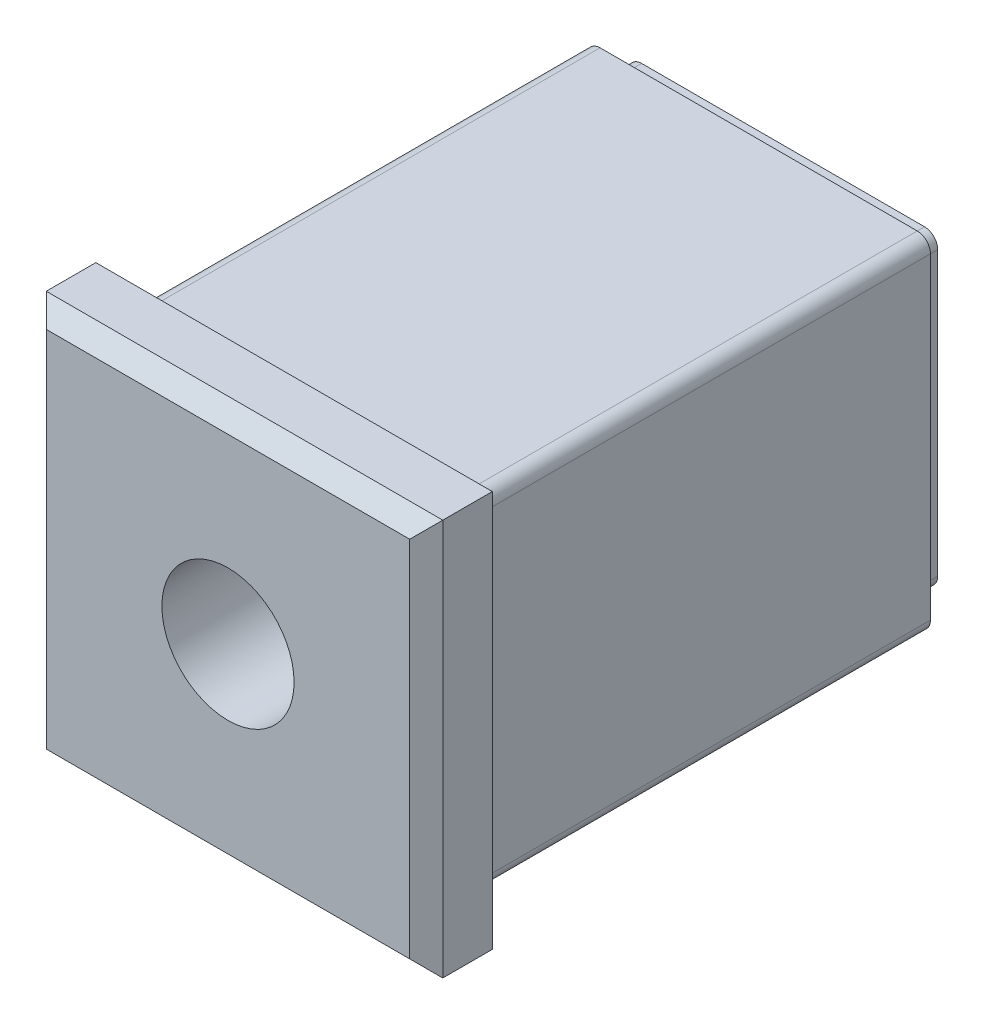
ISO-10303-21;
HEADER;
FILE_DESCRIPTION(('STEP AP214'),'2;1');
FILE_NAME('part.step','',(''),(''),'','','');
FILE_SCHEMA(('AUTOMOTIVE_DESIGN { 1 0 10303 214 1 1 1 1 }'));
ENDSEC;
DATA;
#1=APPLICATION_CONTEXT('core data for automotive mechanical design processes');
#2=APPLICATION_PROTOCOL_DEFINITION('international standard','automotive_design',2000,#1);
#3=PRODUCT_CONTEXT('',#1,'mechanical');
#4=PRODUCT('Part','Part','',(#3));
#5=PRODUCT_RELATED_PRODUCT_CATEGORY('part','',(#4));
#6=PRODUCT_DEFINITION_FORMATION('','',#4);
#7=PRODUCT_DEFINITION_CONTEXT('part definition',#1,'design');
#8=PRODUCT_DEFINITION('design','',#6,#7);
#9=PRODUCT_DEFINITION_SHAPE('','',#8);
#10=(LENGTH_UNIT() NAMED_UNIT(*) SI_UNIT(.MILLI.,.METRE.));
#11=(NAMED_UNIT(*) PLANE_ANGLE_UNIT() SI_UNIT($,.RADIAN.));
#12=(NAMED_UNIT(*) SI_UNIT($,.STERADIAN.) SOLID_ANGLE_UNIT());
#13=UNCERTAINTY_MEASURE_WITH_UNIT(LENGTH_MEASURE(1.E-05),#10,'distance_accuracy_value','');
#14=(GEOMETRIC_REPRESENTATION_CONTEXT(3) GLOBAL_UNCERTAINTY_ASSIGNED_CONTEXT((#13)) GLOBAL_UNIT_ASSIGNED_CONTEXT((#10,
#11,#12)) REPRESENTATION_CONTEXT('',''));
#15=CARTESIAN_POINT('',(0.,0.,0.));
#16=DIRECTION('',(0.,0.,1.));
#17=DIRECTION('',(1.,0.,0.));
#18=AXIS2_PLACEMENT_3D('',#15,#16,#17);
#19=CARTESIAN_POINT('',(37.,-15.,3.75));
#20=DIRECTION('',(0.,0.707106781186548,-0.707106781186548));
#21=DIRECTION('',(0.,-0.707106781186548,-0.707106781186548));
#22=AXIS2_PLACEMENT_3D('',#19,#20,#21);
#23=PLANE('',#22);
#24=DIRECTION('',(1.,0.,0.));
#25=VECTOR('',#24,1.);
#26=CARTESIAN_POINT('',(0.,-15.,3.75));
#27=LINE('',#26,#25);
#28=CARTESIAN_POINT('',(-15.,-15.,3.75));
#29=VERTEX_POINT('',#28);
#30=CARTESIAN_POINT('',(15.,-15.,3.75));
#31=VERTEX_POINT('',#30);
#32=EDGE_CURVE('E339',#29,#31,#27,.T.);
#33=ORIENTED_EDGE('',*,*,#32,.T.);
#34=DIRECTION('',(0.577350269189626,-0.577350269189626,-0.577350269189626));
#35=VECTOR('',#34,1.);
#36=CARTESIAN_POINT('',(13.75,-13.75,5.));
#37=LINE('',#36,#35);
#38=CARTESIAN_POINT('',(13.75,-13.75,5.));
#39=VERTEX_POINT('',#38);
#40=EDGE_CURVE('E238',#39,#31,#37,.T.);
#41=ORIENTED_EDGE('',*,*,#40,.F.);
#42=DIRECTION('',(-1.,0.,0.));
#43=VECTOR('',#42,1.);
#44=CARTESIAN_POINT('',(-13.75,-13.75,5.));
#45=LINE('',#44,#43);
#46=CARTESIAN_POINT('',(-13.75,-13.75,5.));
#47=VERTEX_POINT('',#46);
#48=EDGE_CURVE('E353',#47,#39,#45,.F.);
#49=ORIENTED_EDGE('',*,*,#48,.F.);
#50=DIRECTION('',(0.577350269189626,0.577350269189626,0.577350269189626));
#51=VECTOR('',#50,1.);
#52=CARTESIAN_POINT('',(-15.,-15.,3.75));
#53=LINE('',#52,#51);
#54=EDGE_CURVE('E354',#29,#47,#53,.T.);
#55=ORIENTED_EDGE('',*,*,#54,.F.);
#56=EDGE_LOOP('',(#33,#41,#49,#55));
#57=FACE_BOUND('',#56,.T.);
#58=ADVANCED_FACE('F14',(#57),#23,.F.);
#59=CARTESIAN_POINT('',(13.75,0.,5.));
#60=DIRECTION('',(0.707106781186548,0.,0.707106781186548));
#61=DIRECTION('',(-0.707106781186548,0.,0.707106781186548));
#62=AXIS2_PLACEMENT_3D('',#59,#60,#61);
#63=PLANE('',#62);
#64=DIRECTION('',(0.,-1.,0.));
#65=VECTOR('',#64,1.);
#66=CARTESIAN_POINT('',(15.,0.,3.75));
#67=LINE('',#66,#65);
#68=CARTESIAN_POINT('',(15.,15.,3.75));
#69=VERTEX_POINT('',#68);
#70=EDGE_CURVE('E360',#69,#31,#67,.T.);
#71=ORIENTED_EDGE('',*,*,#70,.F.);
#72=DIRECTION('',(-0.577350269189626,-0.577350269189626,0.577350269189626));
#73=VECTOR('',#72,1.);
#74=CARTESIAN_POINT('',(15.,15.,3.75));
#75=LINE('',#74,#73);
#76=CARTESIAN_POINT('',(13.75,13.75,5.));
#77=VERTEX_POINT('',#76);
#78=EDGE_CURVE('E189',#69,#77,#75,.T.);
#79=ORIENTED_EDGE('',*,*,#78,.T.);
#80=DIRECTION('',(0.,1.,0.));
#81=VECTOR('',#80,1.);
#82=CARTESIAN_POINT('',(13.75,0.,5.));
#83=LINE('',#82,#81);
#84=EDGE_CURVE('E366',#39,#77,#83,.T.);
#85=ORIENTED_EDGE('',*,*,#84,.F.);
#86=ORIENTED_EDGE('',*,*,#40,.T.);
#87=EDGE_LOOP('',(#71,#79,#85,#86));
#88=FACE_BOUND('',#87,.T.);
#89=ADVANCED_FACE('F437',(#88),#63,.T.);
#90=CARTESIAN_POINT('',(-13.75,0.,5.));
#91=DIRECTION('',(0.,0.,1.));
#92=DIRECTION('',(0.,1.,0.));
#93=AXIS2_PLACEMENT_3D('',#90,#91,#92);
#94=PLANE('',#93);
#95=ORIENTED_EDGE('',*,*,#84,.T.);
#96=DIRECTION('',(-1.,0.,0.));
#97=VECTOR('',#96,1.);
#98=CARTESIAN_POINT('',(13.75,13.75,5.));
#99=LINE('',#98,#97);
#100=CARTESIAN_POINT('',(-13.75,13.75,5.));
#101=VERTEX_POINT('',#100);
#102=EDGE_CURVE('E163',#77,#101,#99,.T.);
#103=ORIENTED_EDGE('',*,*,#102,.T.);
#104=DIRECTION('',(0.,1.,0.));
#105=VECTOR('',#104,1.);
#106=CARTESIAN_POINT('',(-13.75,0.,5.));
#107=LINE('',#106,#105);
#108=EDGE_CURVE('E350',#101,#47,#107,.F.);
#109=ORIENTED_EDGE('',*,*,#108,.T.);
#110=ORIENTED_EDGE('',*,*,#48,.T.);
#111=EDGE_LOOP('',(#95,#103,#109,#110));
#112=FACE_BOUND('',#111,.T.);
#113=CARTESIAN_POINT('',(0.,0.,5.));
#114=DIRECTION('',(0.,0.,1.));
#115=DIRECTION('',(0.,1.,0.));
#116=AXIS2_PLACEMENT_3D('',#113,#114,#115);
#117=CIRCLE('',#116,5.);
#118=CARTESIAN_POINT('',(0.,5.,5.));
#119=VERTEX_POINT('',#118);
#120=EDGE_CURVE('E198',#119,#119,#117,.F.);
#121=ORIENTED_EDGE('',*,*,#120,.T.);
#122=EDGE_LOOP('',(#121));
#123=FACE_BOUND('',#122,.T.);
#124=ADVANCED_FACE('F440',(#112,#123),#94,.T.);
#125=CARTESIAN_POINT('',(-15.,0.,3.75));
#126=DIRECTION('',(-0.707106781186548,0.,0.707106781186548));
#127=DIRECTION('',(-0.707106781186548,0.,-0.707106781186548));
#128=AXIS2_PLACEMENT_3D('',#125,#126,#127);
#129=PLANE('',#128);
#130=ORIENTED_EDGE('',*,*,#108,.F.);
#131=DIRECTION('',(-0.577350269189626,0.577350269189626,-0.577350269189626));
#132=VECTOR('',#131,1.);
#133=CARTESIAN_POINT('',(-13.75,13.75,5.));
#134=LINE('',#133,#132);
#135=CARTESIAN_POINT('',(-15.,15.,3.75));
#136=VERTEX_POINT('',#135);
#137=EDGE_CURVE('E192',#101,#136,#134,.T.);
#138=ORIENTED_EDGE('',*,*,#137,.T.);
#139=DIRECTION('',(0.,1.,0.));
#140=VECTOR('',#139,1.);
#141=CARTESIAN_POINT('',(-15.,0.,3.75));
#142=LINE('',#141,#140);
#143=EDGE_CURVE('E328',#29,#136,#142,.T.);
#144=ORIENTED_EDGE('',*,*,#143,.F.);
#145=ORIENTED_EDGE('',*,*,#54,.T.);
#146=EDGE_LOOP('',(#130,#138,#144,#145));
#147=FACE_BOUND('',#146,.T.);
#148=ADVANCED_FACE('F445',(#147),#129,.T.);
#149=CARTESIAN_POINT('',(15.,0.,-37.));
#150=DIRECTION('',(0.,0.,-1.));
#151=DIRECTION('',(0.,-1.,0.));
#152=AXIS2_PLACEMENT_3D('',#149,#150,#151);
#153=PLANE('',#152);
#154=DIRECTION('',(1.,0.,0.));
#155=VECTOR('',#154,1.);
#156=CARTESIAN_POINT('',(10.7,-11.7,-37.));
#157=LINE('',#156,#155);
#158=CARTESIAN_POINT('',(10.7,-11.7,-37.));
#159=VERTEX_POINT('',#158);
#160=CARTESIAN_POINT('',(-10.7,-11.7,-37.));
#161=VERTEX_POINT('',#160);
#162=EDGE_CURVE('E317',#159,#161,#157,.F.);
#163=ORIENTED_EDGE('',*,*,#162,.T.);
#164=CARTESIAN_POINT('',(-10.7,-10.7,-37.));
#165=DIRECTION('',(0.,0.,1.));
#166=DIRECTION('',(0.,1.,0.));
#167=AXIS2_PLACEMENT_3D('',#164,#165,#166);
#168=CIRCLE('',#167,1.);
#169=CARTESIAN_POINT('',(-11.7,-10.7,-37.));
#170=VERTEX_POINT('',#169);
#171=EDGE_CURVE('E363',#161,#170,#168,.F.);
#172=ORIENTED_EDGE('',*,*,#171,.T.);
#173=DIRECTION('',(0.,-1.,0.));
#174=VECTOR('',#173,1.);
#175=CARTESIAN_POINT('',(-11.7,-10.7,-37.));
#176=LINE('',#175,#174);
#177=CARTESIAN_POINT('',(-11.7,10.7,-37.));
#178=VERTEX_POINT('',#177);
#179=EDGE_CURVE('E322',#170,#178,#176,.F.);
#180=ORIENTED_EDGE('',*,*,#179,.T.);
#181=CARTESIAN_POINT('',(-10.7,10.7,-37.));
#182=DIRECTION('',(0.,0.,1.));
#183=DIRECTION('',(0.,1.,0.));
#184=AXIS2_PLACEMENT_3D('',#181,#182,#183);
#185=CIRCLE('',#184,1.);
#186=CARTESIAN_POINT('',(-10.7,11.7,-37.));
#187=VERTEX_POINT('',#186);
#188=EDGE_CURVE('E213',#178,#187,#185,.F.);
#189=ORIENTED_EDGE('',*,*,#188,.T.);
#190=DIRECTION('',(-1.,0.,0.));
#191=VECTOR('',#190,1.);
#192=CARTESIAN_POINT('',(-10.7,11.7,-37.));
#193=LINE('',#192,#191);
#194=CARTESIAN_POINT('',(10.7,11.7,-37.));
#195=VERTEX_POINT('',#194);
#196=EDGE_CURVE('E185',#187,#195,#193,.F.);
#197=ORIENTED_EDGE('',*,*,#196,.T.);
#198=CARTESIAN_POINT('',(10.7,10.7,-37.));
#199=DIRECTION('',(0.,0.,1.));
#200=DIRECTION('',(0.,1.,0.));
#201=AXIS2_PLACEMENT_3D('',#198,#199,#200);
#202=CIRCLE('',#201,1.);
#203=CARTESIAN_POINT('',(11.7,10.7,-37.));
#204=VERTEX_POINT('',#203);
#205=EDGE_CURVE('E195',#195,#204,#202,.F.);
#206=ORIENTED_EDGE('',*,*,#205,.T.);
#207=DIRECTION('',(0.,1.,0.));
#208=VECTOR('',#207,1.);
#209=CARTESIAN_POINT('',(11.7,10.7,-37.));
#210=LINE('',#209,#208);
#211=CARTESIAN_POINT('',(11.7,-10.7,-37.));
#212=VERTEX_POINT('',#211);
#213=EDGE_CURVE('E166',#204,#212,#210,.F.);
#214=ORIENTED_EDGE('',*,*,#213,.T.);
#215=CARTESIAN_POINT('',(10.7,-10.7,-37.));
#216=DIRECTION('',(0.,0.,1.));
#217=DIRECTION('',(0.,1.,0.));
#218=AXIS2_PLACEMENT_3D('',#215,#216,#217);
#219=CIRCLE('',#218,1.);
#220=EDGE_CURVE('E374',#212,#159,#219,.F.);
#221=ORIENTED_EDGE('',*,*,#220,.T.);
#222=EDGE_LOOP('',(#163,#172,#180,#189,#197,#206,#214,#221));
#223=FACE_BOUND('',#222,.T.);
#224=CARTESIAN_POINT('',(0.,0.,-37.));
#225=DIRECTION('',(0.,0.,-1.));
#226=DIRECTION('',(0.,-1.,0.));
#227=AXIS2_PLACEMENT_3D('',#224,#225,#226);
#228=CIRCLE('',#227,5.);
#229=CARTESIAN_POINT('',(0.,-5.,-37.));
#230=VERTEX_POINT('',#229);
#231=EDGE_CURVE('E649',#230,#230,#228,.T.);
#232=ORIENTED_EDGE('',*,*,#231,.F.);
#233=EDGE_LOOP('',(#232));
#234=FACE_BOUND('',#233,.T.);
#235=ADVANCED_FACE('F386',(#223,#234),#153,.T.);
#236=CARTESIAN_POINT('',(-15.,0.,-37.));
#237=DIRECTION('',(-1.,0.,0.));
#238=DIRECTION('',(0.,1.,0.));
#239=AXIS2_PLACEMENT_3D('',#236,#237,#238);
#240=PLANE('',#239);
#241=ORIENTED_EDGE('',*,*,#143,.T.);
#242=DIRECTION('',(0.,0.,-1.));
#243=VECTOR('',#242,1.);
#244=CARTESIAN_POINT('',(-15.,15.,5.));
#245=LINE('',#244,#243);
#246=CARTESIAN_POINT('',(-15.,15.,0.));
#247=VERTEX_POINT('',#246);
#248=EDGE_CURVE('E173',#136,#247,#245,.T.);
#249=ORIENTED_EDGE('',*,*,#248,.T.);
#250=DIRECTION('',(0.,-1.,0.));
#251=VECTOR('',#250,1.);
#252=CARTESIAN_POINT('',(-15.,0.,0.));
#253=LINE('',#252,#251);
#254=CARTESIAN_POINT('',(-15.,-15.,0.));
#255=VERTEX_POINT('',#254);
#256=EDGE_CURVE('E307',#255,#247,#253,.F.);
#257=ORIENTED_EDGE('',*,*,#256,.F.);
#258=DIRECTION('',(0.,0.,-1.));
#259=VECTOR('',#258,1.);
#260=CARTESIAN_POINT('',(-15.,-15.,-37.));
#261=LINE('',#260,#259);
#262=EDGE_CURVE('E331',#255,#29,#261,.F.);
#263=ORIENTED_EDGE('',*,*,#262,.T.);
#264=EDGE_LOOP('',(#241,#249,#257,#263));
#265=FACE_BOUND('',#264,.T.);
#266=ADVANCED_FACE('F465',(#265),#240,.T.);
#267=CARTESIAN_POINT('',(0.,-15.,5.));
#268=DIRECTION('',(0.,1.,0.));
#269=DIRECTION('',(1.,0.,0.));
#270=AXIS2_PLACEMENT_3D('',#267,#268,#269);
#271=PLANE('',#270);
#272=DIRECTION('',(0.,0.,-1.));
#273=VECTOR('',#272,1.);
#274=CARTESIAN_POINT('',(15.,-15.,5.));
#275=LINE('',#274,#273);
#276=CARTESIAN_POINT('',(15.,-15.,0.));
#277=VERTEX_POINT('',#276);
#278=EDGE_CURVE('E334',#31,#277,#275,.T.);
#279=ORIENTED_EDGE('',*,*,#278,.F.);
#280=ORIENTED_EDGE('',*,*,#32,.F.);
#281=ORIENTED_EDGE('',*,*,#262,.F.);
#282=DIRECTION('',(-1.,0.,0.));
#283=VECTOR('',#282,1.);
#284=CARTESIAN_POINT('',(0.,-15.,0.));
#285=LINE('',#284,#283);
#286=EDGE_CURVE('E330',#277,#255,#285,.T.);
#287=ORIENTED_EDGE('',*,*,#286,.F.);
#288=EDGE_LOOP('',(#279,#280,#281,#287));
#289=FACE_BOUND('',#288,.T.);
#290=ADVANCED_FACE('F468',(#289),#271,.F.);
#291=CARTESIAN_POINT('',(15.,0.,3.75));
#292=DIRECTION('',(1.,0.,0.));
#293=DIRECTION('',(0.,-1.,0.));
#294=AXIS2_PLACEMENT_3D('',#291,#292,#293);
#295=PLANE('',#294);
#296=ORIENTED_EDGE('',*,*,#70,.T.);
#297=ORIENTED_EDGE('',*,*,#278,.T.);
#298=DIRECTION('',(0.,-1.,0.));
#299=VECTOR('',#298,1.);
#300=CARTESIAN_POINT('',(15.,0.,0.));
#301=LINE('',#300,#299);
#302=CARTESIAN_POINT('',(15.,15.,0.));
#303=VERTEX_POINT('',#302);
#304=EDGE_CURVE('E313',#303,#277,#301,.T.);
#305=ORIENTED_EDGE('',*,*,#304,.F.);
#306=DIRECTION('',(0.,0.,-1.));
#307=VECTOR('',#306,1.);
#308=CARTESIAN_POINT('',(15.,15.,-37.));
#309=LINE('',#308,#307);
#310=EDGE_CURVE('E168',#303,#69,#309,.F.);
#311=ORIENTED_EDGE('',*,*,#310,.T.);
#312=EDGE_LOOP('',(#296,#297,#305,#311));
#313=FACE_BOUND('',#312,.T.);
#314=ADVANCED_FACE('F472',(#313),#295,.T.);
#315=CARTESIAN_POINT('',(12.,-13.,0.));
#316=DIRECTION('',(0.,1.,0.));
#317=DIRECTION('',(1.,0.,0.));
#318=AXIS2_PLACEMENT_3D('',#315,#316,#317);
#319=PLANE('',#318);
#320=DIRECTION('',(0.,0.,-1.));
#321=VECTOR('',#320,1.);
#322=CARTESIAN_POINT('',(12.,-13.,0.));
#323=LINE('',#322,#321);
#324=CARTESIAN_POINT('',(12.,-13.,0.));
#325=VERTEX_POINT('',#324);
#326=CARTESIAN_POINT('',(12.,-13.,-35.15));
#327=VERTEX_POINT('',#326);
#328=EDGE_CURVE('E24',#325,#327,#323,.T.);
#329=ORIENTED_EDGE('',*,*,#328,.F.);
#330=DIRECTION('',(1.,0.,0.));
#331=VECTOR('',#330,1.);
#332=CARTESIAN_POINT('',(12.,-13.,0.));
#333=LINE('',#332,#331);
#334=CARTESIAN_POINT('',(-12.,-13.,0.));
#335=VERTEX_POINT('',#334);
#336=EDGE_CURVE('E277',#335,#325,#333,.T.);
#337=ORIENTED_EDGE('',*,*,#336,.F.);
#338=DIRECTION('',(0.,0.,-1.));
#339=VECTOR('',#338,1.);
#340=CARTESIAN_POINT('',(-12.,-13.,0.));
#341=LINE('',#340,#339);
#342=CARTESIAN_POINT('',(-12.,-13.,-35.15));
#343=VERTEX_POINT('',#342);
#344=EDGE_CURVE('E274',#343,#335,#341,.F.);
#345=ORIENTED_EDGE('',*,*,#344,.F.);
#346=DIRECTION('',(1.,0.,0.));
#347=VECTOR('',#346,1.);
#348=CARTESIAN_POINT('',(12.,-13.,-35.15));
#349=LINE('',#348,#347);
#350=EDGE_CURVE('E9',#327,#343,#349,.F.);
#351=ORIENTED_EDGE('',*,*,#350,.F.);
#352=EDGE_LOOP('',(#329,#337,#345,#351));
#353=FACE_BOUND('',#352,.T.);
#354=ADVANCED_FACE('F475',(#353),#319,.F.);
#355=CARTESIAN_POINT('',(12.,-12.,0.));
#356=DIRECTION('',(0.,0.,1.));
#357=DIRECTION('',(0.,1.,0.));
#358=AXIS2_PLACEMENT_3D('',#355,#356,#357);
#359=CYLINDRICAL_SURFACE('',#358,1.);
#360=CARTESIAN_POINT('',(12.,-12.,0.));
#361=DIRECTION('',(0.,0.,1.));
#362=DIRECTION('',(0.,1.,0.));
#363=AXIS2_PLACEMENT_3D('',#360,#361,#362);
#364=CIRCLE('',#363,1.);
#365=CARTESIAN_POINT('',(13.,-12.,0.));
#366=VERTEX_POINT('',#365);
#367=EDGE_CURVE('E293',#366,#325,#364,.F.);
#368=ORIENTED_EDGE('',*,*,#367,.T.);
#369=ORIENTED_EDGE('',*,*,#328,.T.);
#370=CARTESIAN_POINT('',(12.,-12.,-35.15));
#371=DIRECTION('',(0.,0.,1.));
#372=DIRECTION('',(0.,1.,0.));
#373=AXIS2_PLACEMENT_3D('',#370,#371,#372);
#374=CIRCLE('',#373,1.);
#375=CARTESIAN_POINT('',(13.,-12.,-35.15));
#376=VERTEX_POINT('',#375);
#377=EDGE_CURVE('E32',#376,#327,#374,.F.);
#378=ORIENTED_EDGE('',*,*,#377,.F.);
#379=DIRECTION('',(0.,0.,1.));
#380=VECTOR('',#379,1.);
#381=CARTESIAN_POINT('',(13.,-12.,0.));
#382=LINE('',#381,#380);
#383=EDGE_CURVE('E302',#376,#366,#382,.T.);
#384=ORIENTED_EDGE('',*,*,#383,.T.);
#385=EDGE_LOOP('',(#368,#369,#378,#384));
#386=FACE_BOUND('',#385,.T.);
#387=ADVANCED_FACE('F510',(#386),#359,.T.);
#388=CARTESIAN_POINT('',(13.,12.,0.));
#389=DIRECTION('',(-1.,0.,0.));
#390=DIRECTION('',(0.,1.,0.));
#391=AXIS2_PLACEMENT_3D('',#388,#389,#390);
#392=PLANE('',#391);
#393=DIRECTION('',(0.,-1.,0.));
#394=VECTOR('',#393,1.);
#395=CARTESIAN_POINT('',(13.,0.,-35.15));
#396=LINE('',#395,#394);
#397=CARTESIAN_POINT('',(13.,12.,-35.15));
#398=VERTEX_POINT('',#397);
#399=EDGE_CURVE('E152',#398,#376,#396,.T.);
#400=ORIENTED_EDGE('',*,*,#399,.F.);
#401=DIRECTION('',(0.,0.,1.));
#402=VECTOR('',#401,1.);
#403=CARTESIAN_POINT('',(13.,12.,0.));
#404=LINE('',#403,#402);
#405=CARTESIAN_POINT('',(13.,12.,0.));
#406=VERTEX_POINT('',#405);
#407=EDGE_CURVE('E181',#406,#398,#404,.F.);
#408=ORIENTED_EDGE('',*,*,#407,.F.);
#409=DIRECTION('',(0.,-1.,0.));
#410=VECTOR('',#409,1.);
#411=CARTESIAN_POINT('',(13.,0.,0.));
#412=LINE('',#411,#410);
#413=EDGE_CURVE('E300',#366,#406,#412,.F.);
#414=ORIENTED_EDGE('',*,*,#413,.F.);
#415=ORIENTED_EDGE('',*,*,#383,.F.);
#416=EDGE_LOOP('',(#400,#408,#414,#415));
#417=FACE_BOUND('',#416,.T.);
#418=ADVANCED_FACE('F402',(#417),#392,.F.);
#419=CARTESIAN_POINT('',(11.7,10.7,-35.15));
#420=DIRECTION('',(-1.,0.,0.));
#421=DIRECTION('',(0.,1.,0.));
#422=AXIS2_PLACEMENT_3D('',#419,#420,#421);
#423=PLANE('',#422);
#424=ORIENTED_EDGE('',*,*,#213,.F.);
#425=DIRECTION('',(0.,0.,-1.));
#426=VECTOR('',#425,1.);
#427=CARTESIAN_POINT('',(11.7,10.7,-35.15));
#428=LINE('',#427,#426);
#429=CARTESIAN_POINT('',(11.7,10.7,-35.15));
#430=VERTEX_POINT('',#429);
#431=EDGE_CURVE('E159',#430,#204,#428,.T.);
#432=ORIENTED_EDGE('',*,*,#431,.F.);
#433=DIRECTION('',(0.,-1.,0.));
#434=VECTOR('',#433,1.);
#435=CARTESIAN_POINT('',(11.7,0.,-35.15));
#436=LINE('',#435,#434);
#437=CARTESIAN_POINT('',(11.7,-10.7,-35.15));
#438=VERTEX_POINT('',#437);
#439=EDGE_CURVE('E145',#438,#430,#436,.F.);
#440=ORIENTED_EDGE('',*,*,#439,.F.);
#441=DIRECTION('',(0.,0.,-1.));
#442=VECTOR('',#441,1.);
#443=CARTESIAN_POINT('',(11.7,-10.7,-35.15));
#444=LINE('',#443,#442);
#445=EDGE_CURVE('E315',#212,#438,#444,.F.);
#446=ORIENTED_EDGE('',*,*,#445,.F.);
#447=EDGE_LOOP('',(#424,#432,#440,#446));
#448=FACE_BOUND('',#447,.T.);
#449=ADVANCED_FACE('F164',(#448),#423,.F.);
#450=CARTESIAN_POINT('',(10.7,-10.7,-35.15));
#451=DIRECTION('',(0.,0.,1.));
#452=DIRECTION('',(0.,1.,0.));
#453=AXIS2_PLACEMENT_3D('',#450,#451,#452);
#454=CYLINDRICAL_SURFACE('',#453,1.);
#455=CARTESIAN_POINT('',(10.7,-10.7,-35.15));
#456=DIRECTION('',(0.,0.,1.));
#457=DIRECTION('',(0.,1.,0.));
#458=AXIS2_PLACEMENT_3D('',#455,#456,#457);
#459=CIRCLE('',#458,1.);
#460=CARTESIAN_POINT('',(10.7,-11.7,-35.15));
#461=VERTEX_POINT('',#460);
#462=EDGE_CURVE('E148',#438,#461,#459,.F.);
#463=ORIENTED_EDGE('',*,*,#462,.T.);
#464=DIRECTION('',(0.,0.,-1.));
#465=VECTOR('',#464,1.);
#466=CARTESIAN_POINT('',(10.7,-11.7,-35.15));
#467=LINE('',#466,#465);
#468=EDGE_CURVE('E321',#461,#159,#467,.T.);
#469=ORIENTED_EDGE('',*,*,#468,.T.);
#470=ORIENTED_EDGE('',*,*,#220,.F.);
#471=ORIENTED_EDGE('',*,*,#445,.T.);
#472=EDGE_LOOP('',(#463,#469,#470,#471));
#473=FACE_BOUND('',#472,.T.);
#474=ADVANCED_FACE('F392',(#473),#454,.T.);
#475=CARTESIAN_POINT('',(10.7,-11.7,-35.15));
#476=DIRECTION('',(0.,1.,0.));
#477=DIRECTION('',(1.,0.,0.));
#478=AXIS2_PLACEMENT_3D('',#475,#476,#477);
#479=PLANE('',#478);
#480=ORIENTED_EDGE('',*,*,#468,.F.);
#481=DIRECTION('',(-1.,0.,0.));
#482=VECTOR('',#481,1.);
#483=CARTESIAN_POINT('',(0.,-11.7,-35.15));
#484=LINE('',#483,#482);
#485=CARTESIAN_POINT('',(-10.7,-11.7,-35.15));
#486=VERTEX_POINT('',#485);
#487=EDGE_CURVE('E153',#486,#461,#484,.F.);
#488=ORIENTED_EDGE('',*,*,#487,.F.);
#489=DIRECTION('',(0.,0.,-1.));
#490=VECTOR('',#489,1.);
#491=CARTESIAN_POINT('',(-10.7,-11.7,-35.15));
#492=LINE('',#491,#490);
#493=EDGE_CURVE('E318',#161,#486,#492,.F.);
#494=ORIENTED_EDGE('',*,*,#493,.F.);
#495=ORIENTED_EDGE('',*,*,#162,.F.);
#496=EDGE_LOOP('',(#480,#488,#494,#495));
#497=FACE_BOUND('',#496,.T.);
#498=ADVANCED_FACE('F391',(#497),#479,.F.);
#499=CARTESIAN_POINT('',(-10.7,-10.7,-35.15));
#500=DIRECTION('',(0.,0.,1.));
#501=DIRECTION('',(0.,1.,0.));
#502=AXIS2_PLACEMENT_3D('',#499,#500,#501);
#503=CYLINDRICAL_SURFACE('',#502,1.);
#504=CARTESIAN_POINT('',(-10.7,-10.7,-35.15));
#505=DIRECTION('',(0.,0.,1.));
#506=DIRECTION('',(0.,1.,0.));
#507=AXIS2_PLACEMENT_3D('',#504,#505,#506);
#508=CIRCLE('',#507,1.);
#509=CARTESIAN_POINT('',(-11.7,-10.7,-35.15));
#510=VERTEX_POINT('',#509);
#511=EDGE_CURVE('E229',#486,#510,#508,.F.);
#512=ORIENTED_EDGE('',*,*,#511,.T.);
#513=DIRECTION('',(0.,0.,-1.));
#514=VECTOR('',#513,1.);
#515=CARTESIAN_POINT('',(-11.7,-10.7,-35.15));
#516=LINE('',#515,#514);
#517=EDGE_CURVE('E325',#510,#170,#516,.T.);
#518=ORIENTED_EDGE('',*,*,#517,.T.);
#519=ORIENTED_EDGE('',*,*,#171,.F.);
#520=ORIENTED_EDGE('',*,*,#493,.T.);
#521=EDGE_LOOP('',(#512,#518,#519,#520));
#522=FACE_BOUND('',#521,.T.);
#523=ADVANCED_FACE('F379',(#522),#503,.T.);
#524=CARTESIAN_POINT('',(-11.7,-10.7,-35.15));
#525=DIRECTION('',(1.,0.,0.));
#526=DIRECTION('',(0.,-1.,0.));
#527=AXIS2_PLACEMENT_3D('',#524,#525,#526);
#528=PLANE('',#527);
#529=ORIENTED_EDGE('',*,*,#517,.F.);
#530=DIRECTION('',(0.,-1.,0.));
#531=VECTOR('',#530,1.);
#532=CARTESIAN_POINT('',(-11.7,0.,-35.15));
#533=LINE('',#532,#531);
#534=CARTESIAN_POINT('',(-11.7,10.7,-35.15));
#535=VERTEX_POINT('',#534);
#536=EDGE_CURVE('E291',#535,#510,#533,.T.);
#537=ORIENTED_EDGE('',*,*,#536,.F.);
#538=DIRECTION('',(0.,0.,-1.));
#539=VECTOR('',#538,1.);
#540=CARTESIAN_POINT('',(-11.7,10.7,-35.15));
#541=LINE('',#540,#539);
#542=EDGE_CURVE('E188',#178,#535,#541,.F.);
#543=ORIENTED_EDGE('',*,*,#542,.F.);
#544=ORIENTED_EDGE('',*,*,#179,.F.);
#545=EDGE_LOOP('',(#529,#537,#543,#544));
#546=FACE_BOUND('',#545,.T.);
#547=ADVANCED_FACE('F384',(#546),#528,.F.);
#548=CARTESIAN_POINT('',(-13.,-12.,0.));
#549=DIRECTION('',(1.,0.,0.));
#550=DIRECTION('',(0.,-1.,0.));
#551=AXIS2_PLACEMENT_3D('',#548,#549,#550);
#552=PLANE('',#551);
#553=DIRECTION('',(0.,0.,1.));
#554=VECTOR('',#553,1.);
#555=CARTESIAN_POINT('',(-13.,-12.,0.));
#556=LINE('',#555,#554);
#557=CARTESIAN_POINT('',(-13.,-12.,0.));
#558=VERTEX_POINT('',#557);
#559=CARTESIAN_POINT('',(-13.,-12.,-35.15));
#560=VERTEX_POINT('',#559);
#561=EDGE_CURVE('E310',#558,#560,#556,.F.);
#562=ORIENTED_EDGE('',*,*,#561,.F.);
#563=DIRECTION('',(0.,-1.,0.));
#564=VECTOR('',#563,1.);
#565=CARTESIAN_POINT('',(-13.,0.,0.));
#566=LINE('',#565,#564);
#567=CARTESIAN_POINT('',(-13.,12.,0.));
#568=VERTEX_POINT('',#567);
#569=EDGE_CURVE('E258',#568,#558,#566,.T.);
#570=ORIENTED_EDGE('',*,*,#569,.F.);
#571=DIRECTION('',(0.,0.,1.));
#572=VECTOR('',#571,1.);
#573=CARTESIAN_POINT('',(-13.,12.,0.));
#574=LINE('',#573,#572);
#575=CARTESIAN_POINT('',(-13.,12.,-35.15));
#576=VERTEX_POINT('',#575);
#577=EDGE_CURVE('E210',#576,#568,#574,.T.);
#578=ORIENTED_EDGE('',*,*,#577,.F.);
#579=DIRECTION('',(0.,-1.,0.));
#580=VECTOR('',#579,1.);
#581=CARTESIAN_POINT('',(-13.,0.,-35.15));
#582=LINE('',#581,#580);
#583=EDGE_CURVE('E270',#560,#576,#582,.F.);
#584=ORIENTED_EDGE('',*,*,#583,.F.);
#585=EDGE_LOOP('',(#562,#570,#578,#584));
#586=FACE_BOUND('',#585,.T.);
#587=ADVANCED_FACE('F456',(#586),#552,.F.);
#588=CARTESIAN_POINT('',(-12.,-12.,0.));
#589=DIRECTION('',(0.,0.,1.));
#590=DIRECTION('',(0.,1.,0.));
#591=AXIS2_PLACEMENT_3D('',#588,#589,#590);
#592=CYLINDRICAL_SURFACE('',#591,1.);
#593=CARTESIAN_POINT('',(-12.,-12.,0.));
#594=DIRECTION('',(0.,0.,1.));
#595=DIRECTION('',(0.,1.,0.));
#596=AXIS2_PLACEMENT_3D('',#593,#594,#595);
#597=CIRCLE('',#596,1.);
#598=EDGE_CURVE('E303',#558,#335,#597,.T.);
#599=ORIENTED_EDGE('',*,*,#598,.F.);
#600=ORIENTED_EDGE('',*,*,#561,.T.);
#601=CARTESIAN_POINT('',(-12.,-12.,-35.15));
#602=DIRECTION('',(0.,0.,1.));
#603=DIRECTION('',(0.,1.,0.));
#604=AXIS2_PLACEMENT_3D('',#601,#602,#603);
#605=CIRCLE('',#604,1.);
#606=EDGE_CURVE('E273',#343,#560,#605,.F.);
#607=ORIENTED_EDGE('',*,*,#606,.F.);
#608=ORIENTED_EDGE('',*,*,#344,.T.);
#609=EDGE_LOOP('',(#599,#600,#607,#608));
#610=FACE_BOUND('',#609,.T.);
#611=ADVANCED_FACE('F462',(#610),#592,.T.);
#612=CARTESIAN_POINT('',(0.,0.,-35.15));
#613=DIRECTION('',(0.,0.,-1.));
#614=DIRECTION('',(0.,-1.,0.));
#615=AXIS2_PLACEMENT_3D('',#612,#613,#614);
#616=PLANE('',#615);
#617=ORIENTED_EDGE('',*,*,#439,.T.);
#618=CARTESIAN_POINT('',(10.7,10.7,-35.15));
#619=DIRECTION('',(0.,0.,1.));
#620=DIRECTION('',(0.,1.,0.));
#621=AXIS2_PLACEMENT_3D('',#618,#619,#620);
#622=CIRCLE('',#621,1.);
#623=CARTESIAN_POINT('',(10.7,11.7,-35.15));
#624=VERTEX_POINT('',#623);
#625=EDGE_CURVE('E18',#624,#430,#622,.F.);
#626=ORIENTED_EDGE('',*,*,#625,.F.);
#627=DIRECTION('',(-1.,0.,0.));
#628=VECTOR('',#627,1.);
#629=CARTESIAN_POINT('',(0.,11.7,-35.15));
#630=LINE('',#629,#628);
#631=CARTESIAN_POINT('',(-10.7,11.7,-35.15));
#632=VERTEX_POINT('',#631);
#633=EDGE_CURVE('E207',#624,#632,#630,.T.);
#634=ORIENTED_EDGE('',*,*,#633,.T.);
#635=CARTESIAN_POINT('',(-10.7,10.7,-35.15));
#636=DIRECTION('',(0.,0.,1.));
#637=DIRECTION('',(0.,1.,0.));
#638=AXIS2_PLACEMENT_3D('',#635,#636,#637);
#639=CIRCLE('',#638,1.);
#640=EDGE_CURVE('E162',#535,#632,#639,.F.);
#641=ORIENTED_EDGE('',*,*,#640,.F.);
#642=ORIENTED_EDGE('',*,*,#536,.T.);
#643=ORIENTED_EDGE('',*,*,#511,.F.);
#644=ORIENTED_EDGE('',*,*,#487,.T.);
#645=ORIENTED_EDGE('',*,*,#462,.F.);
#646=EDGE_LOOP('',(#617,#626,#634,#641,#642,#643,#644,#645));
#647=FACE_BOUND('',#646,.T.);
#648=ORIENTED_EDGE('',*,*,#606,.T.);
#649=ORIENTED_EDGE('',*,*,#583,.T.);
#650=CARTESIAN_POINT('',(-12.,12.,-35.15));
#651=DIRECTION('',(0.,0.,1.));
#652=DIRECTION('',(0.,1.,0.));
#653=AXIS2_PLACEMENT_3D('',#650,#651,#652);
#654=CIRCLE('',#653,1.);
#655=CARTESIAN_POINT('',(-12.,13.,-35.15));
#656=VERTEX_POINT('',#655);
#657=EDGE_CURVE('E205',#576,#656,#654,.F.);
#658=ORIENTED_EDGE('',*,*,#657,.T.);
#659=DIRECTION('',(-1.,0.,0.));
#660=VECTOR('',#659,1.);
#661=CARTESIAN_POINT('',(-12.,13.,-35.15));
#662=LINE('',#661,#660);
#663=CARTESIAN_POINT('',(12.,13.,-35.15));
#664=VERTEX_POINT('',#663);
#665=EDGE_CURVE('E234',#656,#664,#662,.F.);
#666=ORIENTED_EDGE('',*,*,#665,.T.);
#667=CARTESIAN_POINT('',(12.,12.,-35.15));
#668=DIRECTION('',(0.,0.,1.));
#669=DIRECTION('',(0.,1.,0.));
#670=AXIS2_PLACEMENT_3D('',#667,#668,#669);
#671=CIRCLE('',#670,1.);
#672=EDGE_CURVE('E201',#664,#398,#671,.F.);
#673=ORIENTED_EDGE('',*,*,#672,.T.);
#674=ORIENTED_EDGE('',*,*,#399,.T.);
#675=ORIENTED_EDGE('',*,*,#377,.T.);
#676=ORIENTED_EDGE('',*,*,#350,.T.);
#677=EDGE_LOOP('',(#648,#649,#658,#666,#673,#674,#675,#676));
#678=FACE_BOUND('',#677,.T.);
#679=ADVANCED_FACE('F146',(#647,#678),#616,.T.);
#680=CARTESIAN_POINT('',(0.,0.,0.));
#681=DIRECTION('',(0.,0.,-1.));
#682=DIRECTION('',(0.,-1.,0.));
#683=AXIS2_PLACEMENT_3D('',#680,#681,#682);
#684=PLANE('',#683);
#685=DIRECTION('',(-1.,0.,0.));
#686=VECTOR('',#685,1.);
#687=CARTESIAN_POINT('',(0.,15.,0.));
#688=LINE('',#687,#686);
#689=EDGE_CURVE('E177',#247,#303,#688,.F.);
#690=ORIENTED_EDGE('',*,*,#689,.T.);
#691=ORIENTED_EDGE('',*,*,#304,.T.);
#692=ORIENTED_EDGE('',*,*,#286,.T.);
#693=ORIENTED_EDGE('',*,*,#256,.T.);
#694=EDGE_LOOP('',(#690,#691,#692,#693));
#695=FACE_BOUND('',#694,.T.);
#696=ORIENTED_EDGE('',*,*,#367,.F.);
#697=ORIENTED_EDGE('',*,*,#413,.T.);
#698=CARTESIAN_POINT('',(12.,12.,0.));
#699=DIRECTION('',(0.,0.,1.));
#700=DIRECTION('',(0.,1.,0.));
#701=AXIS2_PLACEMENT_3D('',#698,#699,#700);
#702=CIRCLE('',#701,1.);
#703=CARTESIAN_POINT('',(12.,13.,0.));
#704=VERTEX_POINT('',#703);
#705=EDGE_CURVE('E180',#406,#704,#702,.T.);
#706=ORIENTED_EDGE('',*,*,#705,.T.);
#707=DIRECTION('',(-1.,0.,0.));
#708=VECTOR('',#707,1.);
#709=CARTESIAN_POINT('',(-12.,13.,0.));
#710=LINE('',#709,#708);
#711=CARTESIAN_POINT('',(-12.,13.,0.));
#712=VERTEX_POINT('',#711);
#713=EDGE_CURVE('E235',#704,#712,#710,.T.);
#714=ORIENTED_EDGE('',*,*,#713,.T.);
#715=CARTESIAN_POINT('',(-12.,12.,0.));
#716=DIRECTION('',(0.,0.,1.));
#717=DIRECTION('',(0.,1.,0.));
#718=AXIS2_PLACEMENT_3D('',#715,#716,#717);
#719=CIRCLE('',#718,1.);
#720=EDGE_CURVE('E208',#568,#712,#719,.F.);
#721=ORIENTED_EDGE('',*,*,#720,.F.);
#722=ORIENTED_EDGE('',*,*,#569,.T.);
#723=ORIENTED_EDGE('',*,*,#598,.T.);
#724=ORIENTED_EDGE('',*,*,#336,.T.);
#725=EDGE_LOOP('',(#696,#697,#706,#714,#721,#722,#723,#724));
#726=FACE_BOUND('',#725,.T.);
#727=ADVANCED_FACE('F257',(#695,#726),#684,.T.);
#728=CARTESIAN_POINT('',(-30.,15.,3.75));
#729=DIRECTION('',(0.,-0.707106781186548,-0.707106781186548));
#730=DIRECTION('',(0.,-0.707106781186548,0.707106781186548));
#731=AXIS2_PLACEMENT_3D('',#728,#729,#730);
#732=PLANE('',#731);
#733=DIRECTION('',(-1.,0.,0.));
#734=VECTOR('',#733,1.);
#735=CARTESIAN_POINT('',(0.,15.,3.75));
#736=LINE('',#735,#734);
#737=EDGE_CURVE('E184',#69,#136,#736,.T.);
#738=ORIENTED_EDGE('',*,*,#737,.T.);
#739=ORIENTED_EDGE('',*,*,#137,.F.);
#740=ORIENTED_EDGE('',*,*,#102,.F.);
#741=ORIENTED_EDGE('',*,*,#78,.F.);
#742=EDGE_LOOP('',(#738,#739,#740,#741));
#743=FACE_BOUND('',#742,.T.);
#744=ADVANCED_FACE('F16',(#743),#732,.F.);
#745=CARTESIAN_POINT('',(0.,15.,5.));
#746=DIRECTION('',(0.,-1.,0.));
#747=DIRECTION('',(-1.,0.,0.));
#748=AXIS2_PLACEMENT_3D('',#745,#746,#747);
#749=PLANE('',#748);
#750=ORIENTED_EDGE('',*,*,#248,.F.);
#751=ORIENTED_EDGE('',*,*,#737,.F.);
#752=ORIENTED_EDGE('',*,*,#310,.F.);
#753=ORIENTED_EDGE('',*,*,#689,.F.);
#754=EDGE_LOOP('',(#750,#751,#752,#753));
#755=FACE_BOUND('',#754,.T.);
#756=ADVANCED_FACE('F407',(#755),#749,.F.);
#757=CARTESIAN_POINT('',(-12.,13.,0.));
#758=DIRECTION('',(0.,-1.,0.));
#759=DIRECTION('',(-1.,0.,0.));
#760=AXIS2_PLACEMENT_3D('',#757,#758,#759);
#761=PLANE('',#760);
#762=DIRECTION('',(0.,0.,-1.));
#763=VECTOR('',#762,1.);
#764=CARTESIAN_POINT('',(-12.,13.,0.));
#765=LINE('',#764,#763);
#766=EDGE_CURVE('E231',#712,#656,#765,.T.);
#767=ORIENTED_EDGE('',*,*,#766,.F.);
#768=ORIENTED_EDGE('',*,*,#713,.F.);
#769=DIRECTION('',(0.,0.,-1.));
#770=VECTOR('',#769,1.);
#771=CARTESIAN_POINT('',(12.,13.,0.));
#772=LINE('',#771,#770);
#773=EDGE_CURVE('E204',#664,#704,#772,.F.);
#774=ORIENTED_EDGE('',*,*,#773,.F.);
#775=ORIENTED_EDGE('',*,*,#665,.F.);
#776=EDGE_LOOP('',(#767,#768,#774,#775));
#777=FACE_BOUND('',#776,.T.);
#778=ADVANCED_FACE('F263',(#777),#761,.F.);
#779=CARTESIAN_POINT('',(-12.,12.,0.));
#780=DIRECTION('',(0.,0.,1.));
#781=DIRECTION('',(0.,1.,0.));
#782=AXIS2_PLACEMENT_3D('',#779,#780,#781);
#783=CYLINDRICAL_SURFACE('',#782,1.);
#784=ORIENTED_EDGE('',*,*,#720,.T.);
#785=ORIENTED_EDGE('',*,*,#766,.T.);
#786=ORIENTED_EDGE('',*,*,#657,.F.);
#787=ORIENTED_EDGE('',*,*,#577,.T.);
#788=EDGE_LOOP('',(#784,#785,#786,#787));
#789=FACE_BOUND('',#788,.T.);
#790=ADVANCED_FACE('F251',(#789),#783,.T.);
#791=CARTESIAN_POINT('',(-10.7,10.7,-35.15));
#792=DIRECTION('',(0.,0.,1.));
#793=DIRECTION('',(0.,1.,0.));
#794=AXIS2_PLACEMENT_3D('',#791,#792,#793);
#795=CYLINDRICAL_SURFACE('',#794,1.);
#796=ORIENTED_EDGE('',*,*,#640,.T.);
#797=DIRECTION('',(0.,0.,-1.));
#798=VECTOR('',#797,1.);
#799=CARTESIAN_POINT('',(-10.7,11.7,-35.15));
#800=LINE('',#799,#798);
#801=EDGE_CURVE('E170',#632,#187,#800,.T.);
#802=ORIENTED_EDGE('',*,*,#801,.T.);
#803=ORIENTED_EDGE('',*,*,#188,.F.);
#804=ORIENTED_EDGE('',*,*,#542,.T.);
#805=EDGE_LOOP('',(#796,#802,#803,#804));
#806=FACE_BOUND('',#805,.T.);
#807=ADVANCED_FACE('F219',(#806),#795,.T.);
#808=CARTESIAN_POINT('',(-10.7,11.7,-35.15));
#809=DIRECTION('',(0.,-1.,0.));
#810=DIRECTION('',(-1.,0.,0.));
#811=AXIS2_PLACEMENT_3D('',#808,#809,#810);
#812=PLANE('',#811);
#813=ORIENTED_EDGE('',*,*,#801,.F.);
#814=ORIENTED_EDGE('',*,*,#633,.F.);
#815=DIRECTION('',(0.,0.,-1.));
#816=VECTOR('',#815,1.);
#817=CARTESIAN_POINT('',(10.7,11.7,-35.15));
#818=LINE('',#817,#816);
#819=EDGE_CURVE('E160',#195,#624,#818,.F.);
#820=ORIENTED_EDGE('',*,*,#819,.F.);
#821=ORIENTED_EDGE('',*,*,#196,.F.);
#822=EDGE_LOOP('',(#813,#814,#820,#821));
#823=FACE_BOUND('',#822,.T.);
#824=ADVANCED_FACE('F225',(#823),#812,.F.);
#825=CARTESIAN_POINT('',(10.7,10.7,-35.15));
#826=DIRECTION('',(0.,0.,1.));
#827=DIRECTION('',(0.,1.,0.));
#828=AXIS2_PLACEMENT_3D('',#825,#826,#827);
#829=CYLINDRICAL_SURFACE('',#828,1.);
#830=ORIENTED_EDGE('',*,*,#625,.T.);
#831=ORIENTED_EDGE('',*,*,#431,.T.);
#832=ORIENTED_EDGE('',*,*,#205,.F.);
#833=ORIENTED_EDGE('',*,*,#819,.T.);
#834=EDGE_LOOP('',(#830,#831,#832,#833));
#835=FACE_BOUND('',#834,.T.);
#836=ADVANCED_FACE('F157',(#835),#829,.T.);
#837=CARTESIAN_POINT('',(12.,12.,0.));
#838=DIRECTION('',(0.,0.,1.));
#839=DIRECTION('',(0.,1.,0.));
#840=AXIS2_PLACEMENT_3D('',#837,#838,#839);
#841=CYLINDRICAL_SURFACE('',#840,1.);
#842=ORIENTED_EDGE('',*,*,#705,.F.);
#843=ORIENTED_EDGE('',*,*,#407,.T.);
#844=ORIENTED_EDGE('',*,*,#672,.F.);
#845=ORIENTED_EDGE('',*,*,#773,.T.);
#846=EDGE_LOOP('',(#842,#843,#844,#845));
#847=FACE_BOUND('',#846,.T.);
#848=ADVANCED_FACE('F267',(#847),#841,.T.);
#849=CARTESIAN_POINT('',(0.,0.,35.6694625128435));
#850=DIRECTION('',(0.,0.,-1.));
#851=DIRECTION('',(0.,-1.,0.));
#852=AXIS2_PLACEMENT_3D('',#849,#850,#851);
#853=CYLINDRICAL_SURFACE('',#852,5.);
#854=ORIENTED_EDGE('',*,*,#231,.T.);
#855=EDGE_LOOP('',(#854));
#856=FACE_BOUND('',#855,.T.);
#857=ORIENTED_EDGE('',*,*,#120,.F.);
#858=EDGE_LOOP('',(#857));
#859=FACE_BOUND('',#858,.T.);
#860=ADVANCED_FACE('F418',(#856,#859),#853,.F.);
#861=CLOSED_SHELL('',(#58,#89,#124,#148,#235,#266,#290,#314,#354,#387,#418,#449,#474,#498,#523,
#547,#587,#611,#679,#727,#744,#756,#778,#790,#807,#824,#836,#848,#860));
#862=MANIFOLD_SOLID_BREP('B1',#861);
#863=ADVANCED_BREP_SHAPE_REPRESENTATION('',(#18,#862),#14);
#864=SHAPE_DEFINITION_REPRESENTATION(#9,#863);
ENDSEC;
END-ISO-10303-21;
